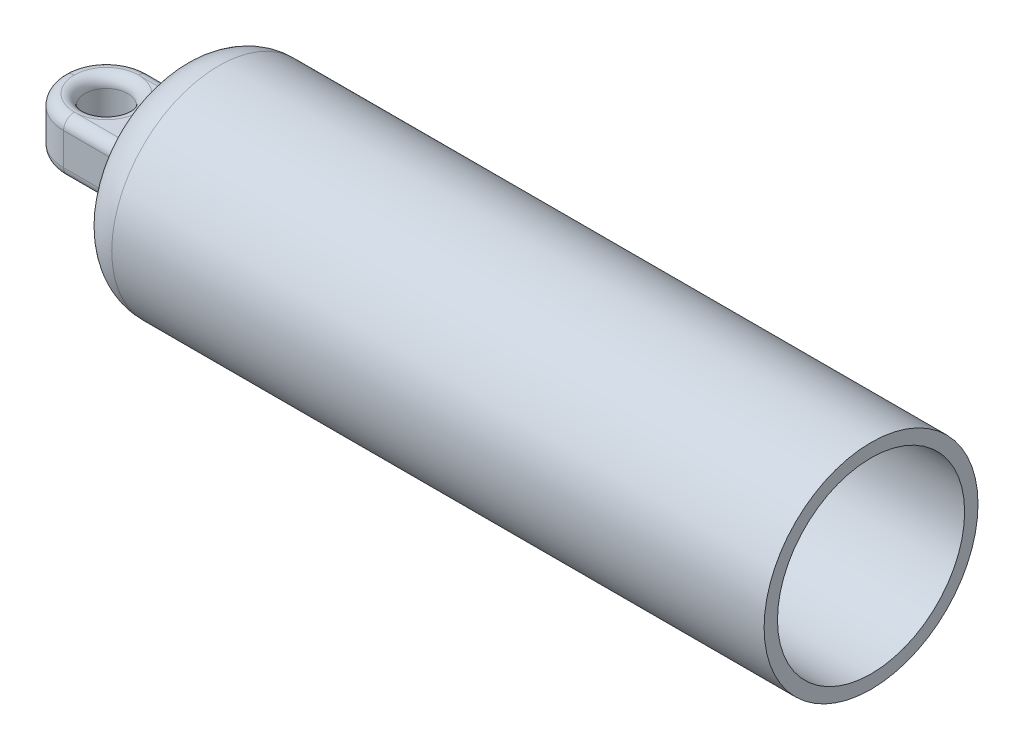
ISO-10303-21;
HEADER;
FILE_DESCRIPTION(('STEP AP214'),'2;1');
FILE_NAME('part.step','',(''),(''),'','','');
FILE_SCHEMA(('AUTOMOTIVE_DESIGN { 1 0 10303 214 1 1 1 1 }'));
ENDSEC;
DATA;
#1=APPLICATION_CONTEXT('core data for automotive mechanical design processes');
#2=APPLICATION_PROTOCOL_DEFINITION('international standard','automotive_design',2000,#1);
#3=PRODUCT_CONTEXT('',#1,'mechanical');
#4=PRODUCT('Part','Part','',(#3));
#5=PRODUCT_RELATED_PRODUCT_CATEGORY('part','',(#4));
#6=PRODUCT_DEFINITION_FORMATION('','',#4);
#7=PRODUCT_DEFINITION_CONTEXT('part definition',#1,'design');
#8=PRODUCT_DEFINITION('design','',#6,#7);
#9=PRODUCT_DEFINITION_SHAPE('','',#8);
#10=(LENGTH_UNIT() NAMED_UNIT(*) SI_UNIT(.MILLI.,.METRE.));
#11=(NAMED_UNIT(*) PLANE_ANGLE_UNIT() SI_UNIT($,.RADIAN.));
#12=(NAMED_UNIT(*) SI_UNIT($,.STERADIAN.) SOLID_ANGLE_UNIT());
#13=UNCERTAINTY_MEASURE_WITH_UNIT(LENGTH_MEASURE(1.E-05),#10,'distance_accuracy_value','');
#14=(GEOMETRIC_REPRESENTATION_CONTEXT(3) GLOBAL_UNCERTAINTY_ASSIGNED_CONTEXT((#13)) GLOBAL_UNIT_ASSIGNED_CONTEXT((#10,
#11,#12)) REPRESENTATION_CONTEXT('',''));
#15=CARTESIAN_POINT('',(0.,0.,0.));
#16=DIRECTION('',(0.,0.,1.));
#17=DIRECTION('',(1.,0.,0.));
#18=AXIS2_PLACEMENT_3D('',#15,#16,#17);
#19=CARTESIAN_POINT('',(125.,0.,0.));
#20=DIRECTION('',(1.,0.,0.));
#21=DIRECTION('',(0.,0.,-1.));
#22=AXIS2_PLACEMENT_3D('',#19,#20,#21);
#23=PLANE('',#22);
#24=CARTESIAN_POINT('',(125.,0.,0.));
#25=DIRECTION('',(1.,0.,0.));
#26=DIRECTION('',(0.,0.,-1.));
#27=AXIS2_PLACEMENT_3D('',#24,#25,#26);
#28=CIRCLE('',#27,20.);
#29=CARTESIAN_POINT('',(125.,0.,-20.));
#30=VERTEX_POINT('',#29);
#31=EDGE_CURVE('E614',#30,#30,#28,.T.);
#32=ORIENTED_EDGE('',*,*,#31,.T.);
#33=EDGE_LOOP('',(#32));
#34=FACE_BOUND('',#33,.T.);
#35=CARTESIAN_POINT('',(125.,0.,0.));
#36=DIRECTION('',(1.,0.,0.));
#37=DIRECTION('',(0.,0.,-1.));
#38=AXIS2_PLACEMENT_3D('',#35,#36,#37);
#39=CIRCLE('',#38,17.5);
#40=CARTESIAN_POINT('',(125.,0.,-17.5));
#41=VERTEX_POINT('',#40);
#42=EDGE_CURVE('E236',#41,#41,#39,.T.);
#43=ORIENTED_EDGE('',*,*,#42,.F.);
#44=EDGE_LOOP('',(#43));
#45=FACE_BOUND('',#44,.T.);
#46=ADVANCED_FACE('F34',(#34,#45),#23,.T.);
#47=CARTESIAN_POINT('',(125.,0.,0.));
#48=DIRECTION('',(-1.,0.,0.));
#49=DIRECTION('',(0.,0.,1.));
#50=AXIS2_PLACEMENT_3D('',#47,#48,#49);
#51=CYLINDRICAL_SURFACE('',#50,20.);
#52=CARTESIAN_POINT('',(3.,0.,0.));
#53=DIRECTION('',(-1.,0.,0.));
#54=DIRECTION('',(0.,0.,1.));
#55=AXIS2_PLACEMENT_3D('',#52,#53,#54);
#56=CIRCLE('',#55,20.);
#57=CARTESIAN_POINT('',(3.,0.,20.));
#58=VERTEX_POINT('',#57);
#59=EDGE_CURVE('E621',#58,#58,#56,.F.);
#60=ORIENTED_EDGE('',*,*,#59,.T.);
#61=EDGE_LOOP('',(#60));
#62=FACE_BOUND('',#61,.T.);
#63=ORIENTED_EDGE('',*,*,#31,.F.);
#64=EDGE_LOOP('',(#63));
#65=FACE_BOUND('',#64,.T.);
#66=ADVANCED_FACE('F338',(#62,#65),#51,.T.);
#67=CARTESIAN_POINT('',(125.,0.,0.));
#68=DIRECTION('',(-1.,0.,0.));
#69=DIRECTION('',(0.,0.,1.));
#70=AXIS2_PLACEMENT_3D('',#67,#68,#69);
#71=CYLINDRICAL_SURFACE('',#70,17.5);
#72=ORIENTED_EDGE('',*,*,#42,.T.);
#73=EDGE_LOOP('',(#72));
#74=FACE_BOUND('',#73,.T.);
#75=CARTESIAN_POINT('',(0.,0.,0.));
#76=DIRECTION('',(1.,0.,0.));
#77=DIRECTION('',(0.,0.,-1.));
#78=AXIS2_PLACEMENT_3D('',#75,#76,#77);
#79=CIRCLE('',#78,17.5);
#80=CARTESIAN_POINT('',(0.,0.,-17.5));
#81=VERTEX_POINT('',#80);
#82=EDGE_CURVE('E230',#81,#81,#79,.T.);
#83=ORIENTED_EDGE('',*,*,#82,.F.);
#84=EDGE_LOOP('',(#83));
#85=FACE_BOUND('',#84,.T.);
#86=ADVANCED_FACE('F344',(#74,#85),#71,.F.);
#87=CARTESIAN_POINT('',(0.,0.,0.));
#88=DIRECTION('',(-1.,0.,0.));
#89=DIRECTION('',(0.,0.,1.));
#90=AXIS2_PLACEMENT_3D('',#87,#88,#89);
#91=PLANE('',#90);
#92=ORIENTED_EDGE('',*,*,#82,.T.);
#93=EDGE_LOOP('',(#92));
#94=FACE_BOUND('',#93,.T.);
#95=ADVANCED_FACE('F527',(#94),#91,.F.);
#96=CARTESIAN_POINT('',(-5.,0.,0.));
#97=DIRECTION('',(-1.,0.,0.));
#98=DIRECTION('',(0.,0.,1.));
#99=AXIS2_PLACEMENT_3D('',#96,#97,#98);
#100=PLANE('',#99);
#101=CARTESIAN_POINT('',(-5.,3.,-6.));
#102=DIRECTION('',(-1.,0.,0.));
#103=DIRECTION('',(0.,0.,1.));
#104=AXIS2_PLACEMENT_3D('',#101,#102,#103);
#105=CIRCLE('',#104,4.);
#106=CARTESIAN_POINT('',(-5.,7.,-6.));
#107=VERTEX_POINT('',#106);
#108=CARTESIAN_POINT('',(-5.,3.,-10.));
#109=VERTEX_POINT('',#108);
#110=EDGE_CURVE('E153',#107,#109,#105,.T.);
#111=ORIENTED_EDGE('',*,*,#110,.F.);
#112=DIRECTION('',(0.,0.,1.));
#113=VECTOR('',#112,1.);
#114=CARTESIAN_POINT('',(-5.,7.,0.));
#115=LINE('',#114,#113);
#116=CARTESIAN_POINT('',(-5.,7.,6.));
#117=VERTEX_POINT('',#116);
#118=EDGE_CURVE('E11',#107,#117,#115,.T.);
#119=ORIENTED_EDGE('',*,*,#118,.T.);
#120=CARTESIAN_POINT('',(-5.,3.,6.));
#121=DIRECTION('',(-1.,0.,0.));
#122=DIRECTION('',(0.,0.,1.));
#123=AXIS2_PLACEMENT_3D('',#120,#121,#122);
#124=CIRCLE('',#123,4.);
#125=CARTESIAN_POINT('',(-5.,3.,10.));
#126=VERTEX_POINT('',#125);
#127=EDGE_CURVE('E44',#126,#117,#124,.T.);
#128=ORIENTED_EDGE('',*,*,#127,.F.);
#129=DIRECTION('',(0.,1.,0.));
#130=VECTOR('',#129,1.);
#131=CARTESIAN_POINT('',(-5.,-5.,10.));
#132=LINE('',#131,#130);
#133=CARTESIAN_POINT('',(-5.,-3.,10.));
#134=VERTEX_POINT('',#133);
#135=EDGE_CURVE('E150',#126,#134,#132,.F.);
#136=ORIENTED_EDGE('',*,*,#135,.T.);
#137=CARTESIAN_POINT('',(-5.,-3.,6.));
#138=DIRECTION('',(-1.,0.,0.));
#139=DIRECTION('',(0.,0.,1.));
#140=AXIS2_PLACEMENT_3D('',#137,#138,#139);
#141=CIRCLE('',#140,4.);
#142=CARTESIAN_POINT('',(-5.,-7.,6.));
#143=VERTEX_POINT('',#142);
#144=EDGE_CURVE('E170',#143,#134,#141,.T.);
#145=ORIENTED_EDGE('',*,*,#144,.F.);
#146=DIRECTION('',(0.,0.,1.));
#147=VECTOR('',#146,1.);
#148=CARTESIAN_POINT('',(-5.,-7.,-8.));
#149=LINE('',#148,#147);
#150=CARTESIAN_POINT('',(-5.,-7.,-6.));
#151=VERTEX_POINT('',#150);
#152=EDGE_CURVE('E289',#143,#151,#149,.F.);
#153=ORIENTED_EDGE('',*,*,#152,.T.);
#154=CARTESIAN_POINT('',(-5.,-3.,-6.));
#155=DIRECTION('',(-1.,0.,0.));
#156=DIRECTION('',(0.,0.,1.));
#157=AXIS2_PLACEMENT_3D('',#154,#155,#156);
#158=CIRCLE('',#157,4.);
#159=CARTESIAN_POINT('',(-5.,-3.,-10.));
#160=VERTEX_POINT('',#159);
#161=EDGE_CURVE('E286',#160,#151,#158,.T.);
#162=ORIENTED_EDGE('',*,*,#161,.F.);
#163=DIRECTION('',(0.,-1.,0.));
#164=VECTOR('',#163,1.);
#165=CARTESIAN_POINT('',(-5.,5.,-10.));
#166=LINE('',#165,#164);
#167=EDGE_CURVE('E174',#160,#109,#166,.F.);
#168=ORIENTED_EDGE('',*,*,#167,.T.);
#169=EDGE_LOOP('',(#111,#119,#128,#136,#145,#153,#162,#168));
#170=FACE_BOUND('',#169,.T.);
#171=CARTESIAN_POINT('',(-5.,0.,0.));
#172=DIRECTION('',(-1.,0.,0.));
#173=DIRECTION('',(0.,0.,1.));
#174=AXIS2_PLACEMENT_3D('',#171,#172,#173);
#175=CIRCLE('',#174,12.);
#176=CARTESIAN_POINT('',(-5.,0.,12.));
#177=VERTEX_POINT('',#176);
#178=EDGE_CURVE('E616',#177,#177,#175,.T.);
#179=ORIENTED_EDGE('',*,*,#178,.T.);
#180=EDGE_LOOP('',(#179));
#181=FACE_BOUND('',#180,.T.);
#182=ADVANCED_FACE('F147',(#170,#181),#100,.T.);
#183=CARTESIAN_POINT('',(0.,-5.,8.));
#184=DIRECTION('',(0.,0.,1.));
#185=DIRECTION('',(1.,0.,0.));
#186=AXIS2_PLACEMENT_3D('',#183,#184,#185);
#187=PLANE('',#186);
#188=DIRECTION('',(0.,1.,0.));
#189=VECTOR('',#188,1.);
#190=CARTESIAN_POINT('',(-18.,-5.,8.));
#191=LINE('',#190,#189);
#192=CARTESIAN_POINT('',(-18.,3.,8.));
#193=VERTEX_POINT('',#192);
#194=CARTESIAN_POINT('',(-18.,-3.,8.));
#195=VERTEX_POINT('',#194);
#196=EDGE_CURVE('E240',#193,#195,#191,.F.);
#197=ORIENTED_EDGE('',*,*,#196,.T.);
#198=DIRECTION('',(1.,0.,0.));
#199=VECTOR('',#198,1.);
#200=CARTESIAN_POINT('',(0.,-3.,8.));
#201=LINE('',#200,#199);
#202=CARTESIAN_POINT('',(-7.,-3.,8.));
#203=VERTEX_POINT('',#202);
#204=EDGE_CURVE('E245',#195,#203,#201,.T.);
#205=ORIENTED_EDGE('',*,*,#204,.T.);
#206=DIRECTION('',(0.,1.,0.));
#207=VECTOR('',#206,1.);
#208=CARTESIAN_POINT('',(-7.,5.,8.));
#209=LINE('',#208,#207);
#210=CARTESIAN_POINT('',(-7.,3.,8.));
#211=VERTEX_POINT('',#210);
#212=EDGE_CURVE('E242',#203,#211,#209,.T.);
#213=ORIENTED_EDGE('',*,*,#212,.T.);
#214=DIRECTION('',(1.,0.,0.));
#215=VECTOR('',#214,1.);
#216=CARTESIAN_POINT('',(-18.,3.,8.));
#217=LINE('',#216,#215);
#218=EDGE_CURVE('E78',#211,#193,#217,.F.);
#219=ORIENTED_EDGE('',*,*,#218,.T.);
#220=EDGE_LOOP('',(#197,#205,#213,#219));
#221=FACE_BOUND('',#220,.T.);
#222=ADVANCED_FACE('F526',(#221),#187,.T.);
#223=CARTESIAN_POINT('',(0.,-5.,-8.));
#224=DIRECTION('',(0.,0.,-1.));
#225=DIRECTION('',(-1.,0.,0.));
#226=AXIS2_PLACEMENT_3D('',#223,#224,#225);
#227=PLANE('',#226);
#228=DIRECTION('',(0.,-1.,0.));
#229=VECTOR('',#228,1.);
#230=CARTESIAN_POINT('',(-7.,-5.,-8.));
#231=LINE('',#230,#229);
#232=CARTESIAN_POINT('',(-7.,3.,-8.));
#233=VERTEX_POINT('',#232);
#234=CARTESIAN_POINT('',(-7.,-3.,-8.));
#235=VERTEX_POINT('',#234);
#236=EDGE_CURVE('E257',#233,#235,#231,.T.);
#237=ORIENTED_EDGE('',*,*,#236,.T.);
#238=DIRECTION('',(-1.,0.,0.));
#239=VECTOR('',#238,1.);
#240=CARTESIAN_POINT('',(0.,-3.,-8.));
#241=LINE('',#240,#239);
#242=CARTESIAN_POINT('',(-18.,-3.,-8.));
#243=VERTEX_POINT('',#242);
#244=EDGE_CURVE('E261',#235,#243,#241,.T.);
#245=ORIENTED_EDGE('',*,*,#244,.T.);
#246=DIRECTION('',(0.,1.,0.));
#247=VECTOR('',#246,1.);
#248=CARTESIAN_POINT('',(-18.,-5.,-8.));
#249=LINE('',#248,#247);
#250=CARTESIAN_POINT('',(-18.,3.,-8.));
#251=VERTEX_POINT('',#250);
#252=EDGE_CURVE('E315',#243,#251,#249,.T.);
#253=ORIENTED_EDGE('',*,*,#252,.T.);
#254=DIRECTION('',(-1.,0.,0.));
#255=VECTOR('',#254,1.);
#256=CARTESIAN_POINT('',(-5.,3.,-8.));
#257=LINE('',#256,#255);
#258=EDGE_CURVE('E259',#251,#233,#257,.F.);
#259=ORIENTED_EDGE('',*,*,#258,.T.);
#260=EDGE_LOOP('',(#237,#245,#253,#259));
#261=FACE_BOUND('',#260,.T.);
#262=ADVANCED_FACE('F301',(#261),#227,.T.);
#263=CARTESIAN_POINT('',(0.,-5.,0.));
#264=DIRECTION('',(0.,-1.,0.));
#265=DIRECTION('',(0.,0.,-1.));
#266=AXIS2_PLACEMENT_3D('',#263,#264,#265);
#267=PLANE('',#266);
#268=DIRECTION('',(1.,0.,0.));
#269=VECTOR('',#268,1.);
#270=CARTESIAN_POINT('',(0.,-5.,6.));
#271=LINE('',#270,#269);
#272=CARTESIAN_POINT('',(-7.,-5.,6.));
#273=VERTEX_POINT('',#272);
#274=CARTESIAN_POINT('',(-18.,-5.,6.));
#275=VERTEX_POINT('',#274);
#276=EDGE_CURVE('E252',#273,#275,#271,.F.);
#277=ORIENTED_EDGE('',*,*,#276,.T.);
#278=CARTESIAN_POINT('',(-18.,-5.,0.));
#279=DIRECTION('',(0.,-1.,0.));
#280=DIRECTION('',(0.,0.,-1.));
#281=AXIS2_PLACEMENT_3D('',#278,#279,#280);
#282=CIRCLE('',#281,6.);
#283=CARTESIAN_POINT('',(-18.,-5.,-6.));
#284=VERTEX_POINT('',#283);
#285=EDGE_CURVE('E255',#275,#284,#282,.F.);
#286=ORIENTED_EDGE('',*,*,#285,.T.);
#287=DIRECTION('',(-1.,0.,0.));
#288=VECTOR('',#287,1.);
#289=CARTESIAN_POINT('',(0.,-5.,-6.));
#290=LINE('',#289,#288);
#291=CARTESIAN_POINT('',(-7.,-5.,-6.));
#292=VERTEX_POINT('',#291);
#293=EDGE_CURVE('E250',#284,#292,#290,.F.);
#294=ORIENTED_EDGE('',*,*,#293,.T.);
#295=DIRECTION('',(0.,0.,1.));
#296=VECTOR('',#295,1.);
#297=CARTESIAN_POINT('',(-7.,-5.,8.));
#298=LINE('',#297,#296);
#299=EDGE_CURVE('E248',#292,#273,#298,.T.);
#300=ORIENTED_EDGE('',*,*,#299,.T.);
#301=EDGE_LOOP('',(#277,#286,#294,#300));
#302=FACE_BOUND('',#301,.T.);
#303=ADVANCED_FACE('F560',(#302),#267,.T.);
#304=CARTESIAN_POINT('',(-18.,-5.,0.));
#305=DIRECTION('',(0.,1.,0.));
#306=DIRECTION('',(0.,0.,1.));
#307=AXIS2_PLACEMENT_3D('',#304,#305,#306);
#308=CYLINDRICAL_SURFACE('',#307,4.);
#309=CARTESIAN_POINT('',(-18.,-3.,0.));
#310=DIRECTION('',(0.,-1.,0.));
#311=DIRECTION('',(0.,0.,-1.));
#312=AXIS2_PLACEMENT_3D('',#309,#310,#311);
#313=CIRCLE('',#312,4.);
#314=CARTESIAN_POINT('',(-18.,-3.,-4.));
#315=VERTEX_POINT('',#314);
#316=EDGE_CURVE('E274',#315,#315,#313,.T.);
#317=ORIENTED_EDGE('',*,*,#316,.T.);
#318=EDGE_LOOP('',(#317));
#319=FACE_BOUND('',#318,.T.);
#320=CARTESIAN_POINT('',(-18.,3.,0.));
#321=DIRECTION('',(0.,-1.,0.));
#322=DIRECTION('',(0.,0.,-1.));
#323=AXIS2_PLACEMENT_3D('',#320,#321,#322);
#324=CIRCLE('',#323,4.);
#325=CARTESIAN_POINT('',(-18.,3.,-4.));
#326=VERTEX_POINT('',#325);
#327=EDGE_CURVE('E271',#326,#326,#324,.F.);
#328=ORIENTED_EDGE('',*,*,#327,.T.);
#329=EDGE_LOOP('',(#328));
#330=FACE_BOUND('',#329,.T.);
#331=ADVANCED_FACE('F552',(#319,#330),#308,.F.);
#332=CARTESIAN_POINT('',(0.,5.,0.));
#333=DIRECTION('',(0.,-1.,0.));
#334=DIRECTION('',(0.,0.,-1.));
#335=AXIS2_PLACEMENT_3D('',#332,#333,#334);
#336=PLANE('',#335);
#337=DIRECTION('',(-1.,0.,0.));
#338=VECTOR('',#337,1.);
#339=CARTESIAN_POINT('',(-18.,5.,-6.));
#340=LINE('',#339,#338);
#341=CARTESIAN_POINT('',(-7.,5.,-6.));
#342=VERTEX_POINT('',#341);
#343=CARTESIAN_POINT('',(-18.,5.,-6.));
#344=VERTEX_POINT('',#343);
#345=EDGE_CURVE('E279',#342,#344,#340,.T.);
#346=ORIENTED_EDGE('',*,*,#345,.T.);
#347=CARTESIAN_POINT('',(-18.,5.,0.));
#348=DIRECTION('',(0.,-1.,0.));
#349=DIRECTION('',(0.,0.,-1.));
#350=AXIS2_PLACEMENT_3D('',#347,#348,#349);
#351=CIRCLE('',#350,6.);
#352=CARTESIAN_POINT('',(-18.,5.,6.));
#353=VERTEX_POINT('',#352);
#354=EDGE_CURVE('E283',#344,#353,#351,.T.);
#355=ORIENTED_EDGE('',*,*,#354,.T.);
#356=DIRECTION('',(1.,0.,0.));
#357=VECTOR('',#356,1.);
#358=CARTESIAN_POINT('',(-5.,5.,6.));
#359=LINE('',#358,#357);
#360=CARTESIAN_POINT('',(-7.,5.,6.));
#361=VERTEX_POINT('',#360);
#362=EDGE_CURVE('E281',#353,#361,#359,.T.);
#363=ORIENTED_EDGE('',*,*,#362,.T.);
#364=DIRECTION('',(0.,0.,1.));
#365=VECTOR('',#364,1.);
#366=CARTESIAN_POINT('',(-7.,5.,0.));
#367=LINE('',#366,#365);
#368=EDGE_CURVE('E277',#361,#342,#367,.F.);
#369=ORIENTED_EDGE('',*,*,#368,.T.);
#370=EDGE_LOOP('',(#346,#355,#363,#369));
#371=FACE_BOUND('',#370,.T.);
#372=ADVANCED_FACE('F326',(#371),#336,.F.);
#373=CARTESIAN_POINT('',(3.,0.,0.));
#374=DIRECTION('',(-1.,0.,0.));
#375=DIRECTION('',(0.,0.,1.));
#376=AXIS2_PLACEMENT_3D('',#373,#374,#375);
#377=TOROIDAL_SURFACE('',#376,12.,8.);
#378=ORIENTED_EDGE('',*,*,#59,.F.);
#379=EDGE_LOOP('',(#378));
#380=FACE_BOUND('',#379,.T.);
#381=ORIENTED_EDGE('',*,*,#178,.F.);
#382=EDGE_LOOP('',(#381));
#383=FACE_BOUND('',#382,.T.);
#384=ADVANCED_FACE('F352',(#380,#383),#377,.T.);
#385=CARTESIAN_POINT('',(-18.,-5.,0.));
#386=DIRECTION('',(0.,1.,0.));
#387=DIRECTION('',(0.,0.,1.));
#388=AXIS2_PLACEMENT_3D('',#385,#386,#387);
#389=CYLINDRICAL_SURFACE('',#388,8.);
#390=DIRECTION('',(0.,1.,0.));
#391=VECTOR('',#390,1.);
#392=CARTESIAN_POINT('',(-26.,-5.,0.));
#393=LINE('',#392,#391);
#394=CARTESIAN_POINT('',(-26.,-3.,0.));
#395=VERTEX_POINT('',#394);
#396=CARTESIAN_POINT('',(-26.,3.,0.));
#397=VERTEX_POINT('',#396);
#398=EDGE_CURVE('E228',#395,#397,#393,.T.);
#399=ORIENTED_EDGE('',*,*,#398,.F.);
#400=CARTESIAN_POINT('',(-18.,-3.,0.));
#401=DIRECTION('',(0.,-1.,0.));
#402=DIRECTION('',(0.,0.,-1.));
#403=AXIS2_PLACEMENT_3D('',#400,#401,#402);
#404=CIRCLE('',#403,8.);
#405=EDGE_CURVE('E269',#395,#195,#404,.F.);
#406=ORIENTED_EDGE('',*,*,#405,.T.);
#407=ORIENTED_EDGE('',*,*,#196,.F.);
#408=CARTESIAN_POINT('',(-18.,3.,0.));
#409=DIRECTION('',(0.,-1.,0.));
#410=DIRECTION('',(0.,0.,-1.));
#411=AXIS2_PLACEMENT_3D('',#408,#409,#410);
#412=CIRCLE('',#411,8.);
#413=EDGE_CURVE('E267',#193,#397,#412,.T.);
#414=ORIENTED_EDGE('',*,*,#413,.T.);
#415=EDGE_LOOP('',(#399,#406,#407,#414));
#416=FACE_BOUND('',#415,.T.);
#417=ADVANCED_FACE('F317',(#416),#389,.T.);
#418=CARTESIAN_POINT('',(-18.,-5.,0.));
#419=DIRECTION('',(0.,1.,0.));
#420=DIRECTION('',(0.,0.,1.));
#421=AXIS2_PLACEMENT_3D('',#418,#419,#420);
#422=CYLINDRICAL_SURFACE('',#421,8.);
#423=ORIENTED_EDGE('',*,*,#252,.F.);
#424=CARTESIAN_POINT('',(-18.,-3.,0.));
#425=DIRECTION('',(0.,-1.,0.));
#426=DIRECTION('',(0.,0.,-1.));
#427=AXIS2_PLACEMENT_3D('',#424,#425,#426);
#428=CIRCLE('',#427,8.);
#429=EDGE_CURVE('E265',#243,#395,#428,.F.);
#430=ORIENTED_EDGE('',*,*,#429,.T.);
#431=ORIENTED_EDGE('',*,*,#398,.T.);
#432=CARTESIAN_POINT('',(-18.,3.,0.));
#433=DIRECTION('',(0.,-1.,0.));
#434=DIRECTION('',(0.,0.,-1.));
#435=AXIS2_PLACEMENT_3D('',#432,#433,#434);
#436=CIRCLE('',#435,8.);
#437=EDGE_CURVE('E263',#397,#251,#436,.T.);
#438=ORIENTED_EDGE('',*,*,#437,.T.);
#439=EDGE_LOOP('',(#423,#430,#431,#438));
#440=FACE_BOUND('',#439,.T.);
#441=ADVANCED_FACE('F314',(#440),#422,.T.);
#442=CARTESIAN_POINT('',(-18.,3.,0.));
#443=DIRECTION('',(0.,-1.,0.));
#444=DIRECTION('',(0.,0.,-1.));
#445=AXIS2_PLACEMENT_3D('',#442,#443,#444);
#446=TOROIDAL_SURFACE('',#445,6.,2.);
#447=CARTESIAN_POINT('',(-18.,5.,0.));
#448=DIRECTION('',(0.,-1.,0.));
#449=DIRECTION('',(0.,0.,-1.));
#450=AXIS2_PLACEMENT_3D('',#447,#448,#449);
#451=CIRCLE('',#450,6.);
#452=CARTESIAN_POINT('',(-24.,5.,0.));
#453=VERTEX_POINT('',#452);
#454=EDGE_CURVE('E38',#344,#453,#451,.F.);
#455=ORIENTED_EDGE('',*,*,#454,.F.);
#456=CARTESIAN_POINT('',(-18.,3.,-6.));
#457=DIRECTION('',(1.,0.,0.));
#458=DIRECTION('',(0.,0.,-1.));
#459=AXIS2_PLACEMENT_3D('',#456,#457,#458);
#460=CIRCLE('',#459,2.);
#461=EDGE_CURVE('E222',#251,#344,#460,.T.);
#462=ORIENTED_EDGE('',*,*,#461,.F.);
#463=ORIENTED_EDGE('',*,*,#437,.F.);
#464=CARTESIAN_POINT('',(-24.,3.,0.));
#465=DIRECTION('',(0.,0.,1.));
#466=DIRECTION('',(1.,0.,0.));
#467=AXIS2_PLACEMENT_3D('',#464,#465,#466);
#468=CIRCLE('',#467,2.);
#469=EDGE_CURVE('E220',#453,#397,#468,.T.);
#470=ORIENTED_EDGE('',*,*,#469,.F.);
#471=EDGE_LOOP('',(#455,#462,#463,#470));
#472=FACE_BOUND('',#471,.T.);
#473=ADVANCED_FACE('F36',(#472),#446,.T.);
#474=CARTESIAN_POINT('',(-18.,3.,0.));
#475=DIRECTION('',(0.,-1.,0.));
#476=DIRECTION('',(0.,0.,-1.));
#477=AXIS2_PLACEMENT_3D('',#474,#475,#476);
#478=TOROIDAL_SURFACE('',#477,6.,2.);
#479=ORIENTED_EDGE('',*,*,#327,.F.);
#480=EDGE_LOOP('',(#479));
#481=FACE_BOUND('',#480,.T.);
#482=ORIENTED_EDGE('',*,*,#354,.F.);
#483=ORIENTED_EDGE('',*,*,#454,.T.);
#484=CARTESIAN_POINT('',(-18.,5.,0.));
#485=DIRECTION('',(0.,-1.,0.));
#486=DIRECTION('',(0.,0.,-1.));
#487=AXIS2_PLACEMENT_3D('',#484,#485,#486);
#488=CIRCLE('',#487,6.);
#489=EDGE_CURVE('E217',#353,#453,#488,.T.);
#490=ORIENTED_EDGE('',*,*,#489,.F.);
#491=EDGE_LOOP('',(#482,#483,#490));
#492=FACE_BOUND('',#491,.T.);
#493=ADVANCED_FACE('F487',(#481,#492),#478,.T.);
#494=CARTESIAN_POINT('',(0.,3.,-6.));
#495=DIRECTION('',(1.,0.,0.));
#496=DIRECTION('',(0.,0.,-1.));
#497=AXIS2_PLACEMENT_3D('',#494,#495,#496);
#498=CYLINDRICAL_SURFACE('',#497,2.);
#499=ORIENTED_EDGE('',*,*,#461,.T.);
#500=ORIENTED_EDGE('',*,*,#345,.F.);
#501=CARTESIAN_POINT('',(-7.,3.,-6.));
#502=DIRECTION('',(-1.,0.,0.));
#503=DIRECTION('',(0.,0.,1.));
#504=AXIS2_PLACEMENT_3D('',#501,#502,#503);
#505=CIRCLE('',#504,2.);
#506=EDGE_CURVE('E214',#233,#342,#505,.F.);
#507=ORIENTED_EDGE('',*,*,#506,.F.);
#508=ORIENTED_EDGE('',*,*,#258,.F.);
#509=EDGE_LOOP('',(#499,#500,#507,#508));
#510=FACE_BOUND('',#509,.T.);
#511=ADVANCED_FACE('F479',(#510),#498,.T.);
#512=CARTESIAN_POINT('',(-18.,3.,0.));
#513=DIRECTION('',(0.,-1.,0.));
#514=DIRECTION('',(0.,0.,-1.));
#515=AXIS2_PLACEMENT_3D('',#512,#513,#514);
#516=TOROIDAL_SURFACE('',#515,6.,2.);
#517=ORIENTED_EDGE('',*,*,#469,.T.);
#518=ORIENTED_EDGE('',*,*,#413,.F.);
#519=CARTESIAN_POINT('',(-18.,3.,6.));
#520=DIRECTION('',(1.,0.,0.));
#521=DIRECTION('',(0.,0.,-1.));
#522=AXIS2_PLACEMENT_3D('',#519,#520,#521);
#523=CIRCLE('',#522,2.);
#524=EDGE_CURVE('E211',#353,#193,#523,.T.);
#525=ORIENTED_EDGE('',*,*,#524,.F.);
#526=ORIENTED_EDGE('',*,*,#489,.T.);
#527=EDGE_LOOP('',(#517,#518,#525,#526));
#528=FACE_BOUND('',#527,.T.);
#529=ADVANCED_FACE('F321',(#528),#516,.T.);
#530=CARTESIAN_POINT('',(-7.,3.,-6.));
#531=DIRECTION('',(-1.,0.,0.));
#532=DIRECTION('',(0.,0.,1.));
#533=AXIS2_PLACEMENT_3D('',#530,#531,#532);
#534=TOROIDAL_SURFACE('',#533,4.,2.);
#535=CARTESIAN_POINT('',(-7.,3.,-10.));
#536=DIRECTION('',(0.,-1.,0.));
#537=DIRECTION('',(0.,0.,-1.));
#538=AXIS2_PLACEMENT_3D('',#535,#536,#537);
#539=CIRCLE('',#538,2.);
#540=EDGE_CURVE('E205',#233,#109,#539,.F.);
#541=ORIENTED_EDGE('',*,*,#540,.F.);
#542=ORIENTED_EDGE('',*,*,#506,.T.);
#543=CARTESIAN_POINT('',(-7.,7.,-6.));
#544=DIRECTION('',(0.,0.,1.));
#545=DIRECTION('',(1.,0.,0.));
#546=AXIS2_PLACEMENT_3D('',#543,#544,#545);
#547=CIRCLE('',#546,2.);
#548=EDGE_CURVE('E208',#107,#342,#547,.F.);
#549=ORIENTED_EDGE('',*,*,#548,.F.);
#550=ORIENTED_EDGE('',*,*,#110,.T.);
#551=EDGE_LOOP('',(#541,#542,#549,#550));
#552=FACE_BOUND('',#551,.T.);
#553=ADVANCED_FACE('F296',(#552),#534,.F.);
#554=CARTESIAN_POINT('',(0.,3.,6.));
#555=DIRECTION('',(-1.,0.,0.));
#556=DIRECTION('',(0.,0.,1.));
#557=AXIS2_PLACEMENT_3D('',#554,#555,#556);
#558=CYLINDRICAL_SURFACE('',#557,2.);
#559=ORIENTED_EDGE('',*,*,#524,.T.);
#560=ORIENTED_EDGE('',*,*,#218,.F.);
#561=CARTESIAN_POINT('',(-7.,3.,6.));
#562=DIRECTION('',(-1.,0.,0.));
#563=DIRECTION('',(0.,0.,1.));
#564=AXIS2_PLACEMENT_3D('',#561,#562,#563);
#565=CIRCLE('',#564,2.);
#566=EDGE_CURVE('E160',#361,#211,#565,.F.);
#567=ORIENTED_EDGE('',*,*,#566,.F.);
#568=ORIENTED_EDGE('',*,*,#362,.F.);
#569=EDGE_LOOP('',(#559,#560,#567,#568));
#570=FACE_BOUND('',#569,.T.);
#571=ADVANCED_FACE('F323',(#570),#558,.T.);
#572=CARTESIAN_POINT('',(-7.,7.,0.));
#573=DIRECTION('',(0.,0.,1.));
#574=DIRECTION('',(1.,0.,0.));
#575=AXIS2_PLACEMENT_3D('',#572,#573,#574);
#576=CYLINDRICAL_SURFACE('',#575,2.);
#577=ORIENTED_EDGE('',*,*,#548,.T.);
#578=ORIENTED_EDGE('',*,*,#368,.F.);
#579=CARTESIAN_POINT('',(-7.,7.,6.));
#580=DIRECTION('',(0.,0.,-1.));
#581=DIRECTION('',(-1.,0.,0.));
#582=AXIS2_PLACEMENT_3D('',#579,#580,#581);
#583=CIRCLE('',#582,2.);
#584=EDGE_CURVE('E202',#117,#361,#583,.T.);
#585=ORIENTED_EDGE('',*,*,#584,.F.);
#586=ORIENTED_EDGE('',*,*,#118,.F.);
#587=EDGE_LOOP('',(#577,#578,#585,#586));
#588=FACE_BOUND('',#587,.T.);
#589=ADVANCED_FACE('F328',(#588),#576,.F.);
#590=CARTESIAN_POINT('',(-7.,-5.,-10.));
#591=DIRECTION('',(0.,1.,0.));
#592=DIRECTION('',(0.,0.,1.));
#593=AXIS2_PLACEMENT_3D('',#590,#591,#592);
#594=CYLINDRICAL_SURFACE('',#593,2.);
#595=ORIENTED_EDGE('',*,*,#540,.T.);
#596=ORIENTED_EDGE('',*,*,#167,.F.);
#597=CARTESIAN_POINT('',(-7.,-3.,-10.));
#598=DIRECTION('',(0.,1.,0.));
#599=DIRECTION('',(0.,0.,1.));
#600=AXIS2_PLACEMENT_3D('',#597,#598,#599);
#601=CIRCLE('',#600,2.);
#602=EDGE_CURVE('E199',#235,#160,#601,.T.);
#603=ORIENTED_EDGE('',*,*,#602,.F.);
#604=ORIENTED_EDGE('',*,*,#236,.F.);
#605=EDGE_LOOP('',(#595,#596,#603,#604));
#606=FACE_BOUND('',#605,.T.);
#607=ADVANCED_FACE('F298',(#606),#594,.F.);
#608=CARTESIAN_POINT('',(0.,-3.,-6.));
#609=DIRECTION('',(-1.,0.,0.));
#610=DIRECTION('',(0.,0.,1.));
#611=AXIS2_PLACEMENT_3D('',#608,#609,#610);
#612=CYLINDRICAL_SURFACE('',#611,2.);
#613=CARTESIAN_POINT('',(-18.,-3.,-6.));
#614=DIRECTION('',(-1.,0.,0.));
#615=DIRECTION('',(0.,0.,1.));
#616=AXIS2_PLACEMENT_3D('',#613,#614,#615);
#617=CIRCLE('',#616,2.);
#618=EDGE_CURVE('E163',#243,#284,#617,.T.);
#619=ORIENTED_EDGE('',*,*,#618,.F.);
#620=ORIENTED_EDGE('',*,*,#244,.F.);
#621=CARTESIAN_POINT('',(-7.,-3.,-6.));
#622=DIRECTION('',(-1.,0.,0.));
#623=DIRECTION('',(0.,0.,1.));
#624=AXIS2_PLACEMENT_3D('',#621,#622,#623);
#625=CIRCLE('',#624,2.);
#626=EDGE_CURVE('E196',#292,#235,#625,.F.);
#627=ORIENTED_EDGE('',*,*,#626,.F.);
#628=ORIENTED_EDGE('',*,*,#293,.F.);
#629=EDGE_LOOP('',(#619,#620,#627,#628));
#630=FACE_BOUND('',#629,.T.);
#631=ADVANCED_FACE('F308',(#630),#612,.T.);
#632=CARTESIAN_POINT('',(-7.,3.,6.));
#633=DIRECTION('',(-1.,0.,0.));
#634=DIRECTION('',(0.,0.,1.));
#635=AXIS2_PLACEMENT_3D('',#632,#633,#634);
#636=TOROIDAL_SURFACE('',#635,4.,2.);
#637=ORIENTED_EDGE('',*,*,#584,.T.);
#638=ORIENTED_EDGE('',*,*,#566,.T.);
#639=CARTESIAN_POINT('',(-7.,3.,10.));
#640=DIRECTION('',(0.,-1.,0.));
#641=DIRECTION('',(0.,0.,-1.));
#642=AXIS2_PLACEMENT_3D('',#639,#640,#641);
#643=CIRCLE('',#642,2.);
#644=EDGE_CURVE('E157',#126,#211,#643,.F.);
#645=ORIENTED_EDGE('',*,*,#644,.F.);
#646=ORIENTED_EDGE('',*,*,#127,.T.);
#647=EDGE_LOOP('',(#637,#638,#645,#646));
#648=FACE_BOUND('',#647,.T.);
#649=ADVANCED_FACE('F158',(#648),#636,.F.);
#650=CARTESIAN_POINT('',(-7.,-3.,-6.));
#651=DIRECTION('',(-1.,0.,0.));
#652=DIRECTION('',(0.,0.,1.));
#653=AXIS2_PLACEMENT_3D('',#650,#651,#652);
#654=TOROIDAL_SURFACE('',#653,4.,2.);
#655=ORIENTED_EDGE('',*,*,#602,.T.);
#656=ORIENTED_EDGE('',*,*,#161,.T.);
#657=CARTESIAN_POINT('',(-7.,-7.,-6.));
#658=DIRECTION('',(0.,0.,1.));
#659=DIRECTION('',(1.,0.,0.));
#660=AXIS2_PLACEMENT_3D('',#657,#658,#659);
#661=CIRCLE('',#660,2.);
#662=EDGE_CURVE('E164',#292,#151,#661,.F.);
#663=ORIENTED_EDGE('',*,*,#662,.F.);
#664=ORIENTED_EDGE('',*,*,#626,.T.);
#665=EDGE_LOOP('',(#655,#656,#663,#664));
#666=FACE_BOUND('',#665,.T.);
#667=ADVANCED_FACE('F383',(#666),#654,.F.);
#668=CARTESIAN_POINT('',(-18.,-3.,0.));
#669=DIRECTION('',(0.,-1.,0.));
#670=DIRECTION('',(0.,0.,-1.));
#671=AXIS2_PLACEMENT_3D('',#668,#669,#670);
#672=TOROIDAL_SURFACE('',#671,6.,2.);
#673=ORIENTED_EDGE('',*,*,#316,.F.);
#674=EDGE_LOOP('',(#673));
#675=FACE_BOUND('',#674,.T.);
#676=CARTESIAN_POINT('',(-18.,-5.,0.));
#677=DIRECTION('',(0.,-1.,0.));
#678=DIRECTION('',(0.,0.,-1.));
#679=AXIS2_PLACEMENT_3D('',#676,#677,#678);
#680=CIRCLE('',#679,6.);
#681=CARTESIAN_POINT('',(-24.,-5.,0.));
#682=VERTEX_POINT('',#681);
#683=EDGE_CURVE('E62',#284,#682,#680,.F.);
#684=ORIENTED_EDGE('',*,*,#683,.F.);
#685=ORIENTED_EDGE('',*,*,#285,.F.);
#686=CARTESIAN_POINT('',(-18.,-5.,0.));
#687=DIRECTION('',(0.,-1.,0.));
#688=DIRECTION('',(0.,0.,-1.));
#689=AXIS2_PLACEMENT_3D('',#686,#687,#688);
#690=CIRCLE('',#689,6.);
#691=EDGE_CURVE('E189',#682,#275,#690,.F.);
#692=ORIENTED_EDGE('',*,*,#691,.F.);
#693=EDGE_LOOP('',(#684,#685,#692));
#694=FACE_BOUND('',#693,.T.);
#695=ADVANCED_FACE('F380',(#675,#694),#672,.T.);
#696=CARTESIAN_POINT('',(-18.,-3.,0.));
#697=DIRECTION('',(0.,-1.,0.));
#698=DIRECTION('',(0.,0.,-1.));
#699=AXIS2_PLACEMENT_3D('',#696,#697,#698);
#700=TOROIDAL_SURFACE('',#699,6.,2.);
#701=ORIENTED_EDGE('',*,*,#618,.T.);
#702=ORIENTED_EDGE('',*,*,#683,.T.);
#703=CARTESIAN_POINT('',(-24.,-3.,0.));
#704=DIRECTION('',(0.,0.,1.));
#705=DIRECTION('',(1.,0.,0.));
#706=AXIS2_PLACEMENT_3D('',#703,#704,#705);
#707=CIRCLE('',#706,2.);
#708=EDGE_CURVE('E186',#395,#682,#707,.T.);
#709=ORIENTED_EDGE('',*,*,#708,.F.);
#710=ORIENTED_EDGE('',*,*,#429,.F.);
#711=EDGE_LOOP('',(#701,#702,#709,#710));
#712=FACE_BOUND('',#711,.T.);
#713=ADVANCED_FACE('F312',(#712),#700,.T.);
#714=CARTESIAN_POINT('',(-7.,-5.,10.));
#715=DIRECTION('',(0.,-1.,0.));
#716=DIRECTION('',(0.,0.,-1.));
#717=AXIS2_PLACEMENT_3D('',#714,#715,#716);
#718=CYLINDRICAL_SURFACE('',#717,2.);
#719=ORIENTED_EDGE('',*,*,#644,.T.);
#720=ORIENTED_EDGE('',*,*,#212,.F.);
#721=CARTESIAN_POINT('',(-7.,-3.,10.));
#722=DIRECTION('',(0.,1.,0.));
#723=DIRECTION('',(0.,0.,1.));
#724=AXIS2_PLACEMENT_3D('',#721,#722,#723);
#725=CIRCLE('',#724,2.);
#726=EDGE_CURVE('E169',#134,#203,#725,.T.);
#727=ORIENTED_EDGE('',*,*,#726,.F.);
#728=ORIENTED_EDGE('',*,*,#135,.F.);
#729=EDGE_LOOP('',(#719,#720,#727,#728));
#730=FACE_BOUND('',#729,.T.);
#731=ADVANCED_FACE('F167',(#730),#718,.F.);
#732=CARTESIAN_POINT('',(-7.,-7.,0.));
#733=DIRECTION('',(0.,0.,-1.));
#734=DIRECTION('',(-1.,0.,0.));
#735=AXIS2_PLACEMENT_3D('',#732,#733,#734);
#736=CYLINDRICAL_SURFACE('',#735,2.);
#737=ORIENTED_EDGE('',*,*,#662,.T.);
#738=ORIENTED_EDGE('',*,*,#152,.F.);
#739=CARTESIAN_POINT('',(-7.,-7.,6.));
#740=DIRECTION('',(0.,0.,-1.));
#741=DIRECTION('',(-1.,0.,0.));
#742=AXIS2_PLACEMENT_3D('',#739,#740,#741);
#743=CIRCLE('',#742,2.);
#744=EDGE_CURVE('E182',#273,#143,#743,.T.);
#745=ORIENTED_EDGE('',*,*,#744,.F.);
#746=ORIENTED_EDGE('',*,*,#299,.F.);
#747=EDGE_LOOP('',(#737,#738,#745,#746));
#748=FACE_BOUND('',#747,.T.);
#749=ADVANCED_FACE('F371',(#748),#736,.F.);
#750=CARTESIAN_POINT('',(-18.,-3.,0.));
#751=DIRECTION('',(0.,-1.,0.));
#752=DIRECTION('',(0.,0.,-1.));
#753=AXIS2_PLACEMENT_3D('',#750,#751,#752);
#754=TOROIDAL_SURFACE('',#753,6.,2.);
#755=ORIENTED_EDGE('',*,*,#708,.T.);
#756=ORIENTED_EDGE('',*,*,#691,.T.);
#757=CARTESIAN_POINT('',(-18.,-3.,6.));
#758=DIRECTION('',(1.,0.,0.));
#759=DIRECTION('',(0.,0.,-1.));
#760=AXIS2_PLACEMENT_3D('',#757,#758,#759);
#761=CIRCLE('',#760,2.);
#762=EDGE_CURVE('E180',#195,#275,#761,.T.);
#763=ORIENTED_EDGE('',*,*,#762,.F.);
#764=ORIENTED_EDGE('',*,*,#405,.F.);
#765=EDGE_LOOP('',(#755,#756,#763,#764));
#766=FACE_BOUND('',#765,.T.);
#767=ADVANCED_FACE('F367',(#766),#754,.T.);
#768=CARTESIAN_POINT('',(-7.,-3.,6.));
#769=DIRECTION('',(-1.,0.,0.));
#770=DIRECTION('',(0.,0.,1.));
#771=AXIS2_PLACEMENT_3D('',#768,#769,#770);
#772=TOROIDAL_SURFACE('',#771,4.,2.);
#773=ORIENTED_EDGE('',*,*,#144,.T.);
#774=ORIENTED_EDGE('',*,*,#726,.T.);
#775=CARTESIAN_POINT('',(-7.,-3.,6.));
#776=DIRECTION('',(-1.,0.,0.));
#777=DIRECTION('',(0.,0.,1.));
#778=AXIS2_PLACEMENT_3D('',#775,#776,#777);
#779=CIRCLE('',#778,2.);
#780=EDGE_CURVE('E178',#273,#203,#779,.T.);
#781=ORIENTED_EDGE('',*,*,#780,.F.);
#782=ORIENTED_EDGE('',*,*,#744,.T.);
#783=EDGE_LOOP('',(#773,#774,#781,#782));
#784=FACE_BOUND('',#783,.T.);
#785=ADVANCED_FACE('F363',(#784),#772,.F.);
#786=CARTESIAN_POINT('',(0.,-3.,6.));
#787=DIRECTION('',(1.,0.,0.));
#788=DIRECTION('',(0.,0.,-1.));
#789=AXIS2_PLACEMENT_3D('',#786,#787,#788);
#790=CYLINDRICAL_SURFACE('',#789,2.);
#791=ORIENTED_EDGE('',*,*,#762,.T.);
#792=ORIENTED_EDGE('',*,*,#276,.F.);
#793=ORIENTED_EDGE('',*,*,#780,.T.);
#794=ORIENTED_EDGE('',*,*,#204,.F.);
#795=EDGE_LOOP('',(#791,#792,#793,#794));
#796=FACE_BOUND('',#795,.T.);
#797=ADVANCED_FACE('F360',(#796),#790,.T.);
#798=CLOSED_SHELL('',(#46,#66,#86,#95,#182,#222,#262,#303,#331,#372,#384,#417,#441,#473,#493,
#511,#529,#553,#571,#589,#607,#631,#649,#667,#695,#713,#731,#749,#767,#785,#797));
#799=MANIFOLD_SOLID_BREP('B2',#798);
#800=ADVANCED_BREP_SHAPE_REPRESENTATION('',(#18,#799),#14);
#801=SHAPE_DEFINITION_REPRESENTATION(#9,#800);
ENDSEC;
END-ISO-10303-21;
